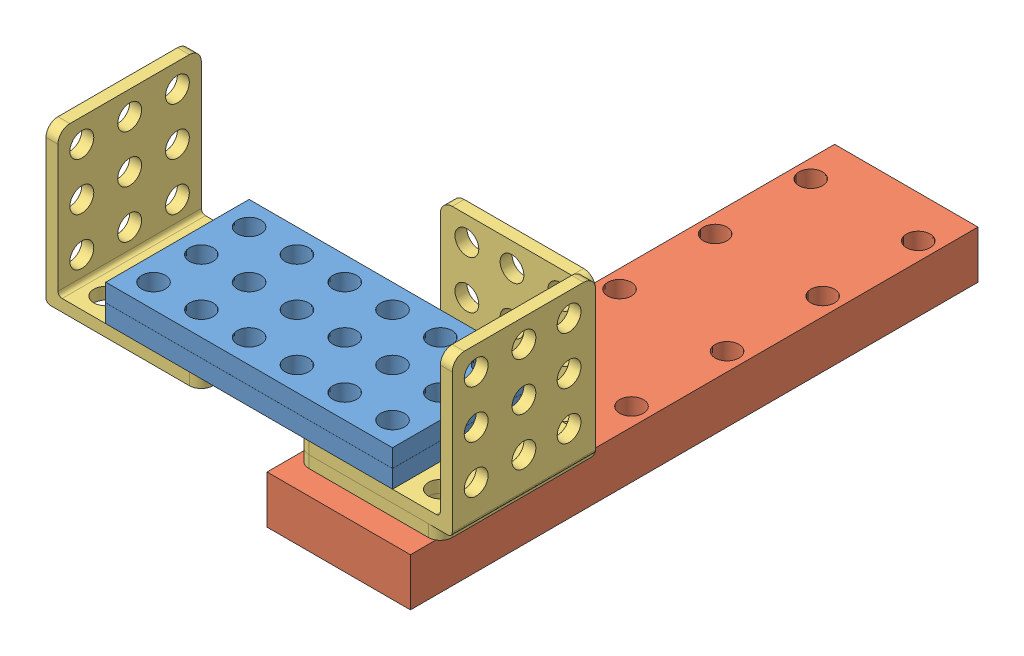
SolidWorks assembly 装甲后.SLDASM, configuration 默认 (file format 10000). Lengths in mm.
Overall size (68 36 95).
6 component instances, 3 part files, 12 mates.
Components (placement in the parent):
- 6x3-1: 6x3.SLDPRT [默认] at (35.4251 -50.7156 52.7098) size (48 3 24)
- 6孔-1: 6孔.SLDPRT [默认] at (57.8547 -62.7156 51.4857) x (0 0 -1) z (1 0 0) size (95 8 24)
- 搞了半天的90度折角件-1: 搞了半天的90度折角件.SLDPRT [默认] at (3.6917 -26.7156 41.7765) x (0 -1 0) z (0 0 1) size (26 26 24)
- 6x3-2: 6x3.SLDPRT [默认] at (35.4251 -47.7041 52.7098) size (48 3 24)
- 搞了半天的90度折角件-2: 搞了半天的90度折角件.SLDPRT [默认] at (45.6917 -52.7156 41.7765) size (26 26 24)
- 搞了半天的90度折角件-3: 搞了半天的90度折角件.SLDPRT [默认] at (45.6917 -54.7156 65.7765) x (0 0 -1) z (1 0 0) size (26 26 24)
Mates (geometry in assembly coordinates):
- 平行1: parallel aligned: line of 6x3-1 through (13.6917 -47.7156 41.7765) axis (0 0 1); line of 搞了半天的90度折角件-1 through (29.6917 -50.7156 43.7765) axis (0 0 1)
- 同心2: concentric aligned: circle of 6x3-1; circle of 6x3-2
- 锁定2: lock: unknown of 6x3-1; unknown of 6x3-2
- 同心3: concentric aligned: circle of 搞了半天的90度折角件-2; circle of 搞了半天的90度折角件-3
- 重合10: coincident aligned: circle of 搞了半天的90度折角件-2; circle of 搞了半天的90度折角件-3
- 重合12: coincident aligned: circle of 6x3-1; circle of 搞了半天的90度折角件-2
- 同心4: concentric aligned: circle of 6x3-2; circle of 搞了半天的90度折角件-3
- 重合17: coincident aligned: circle of 6x3-1; circle of 搞了半天的90度折角件-1
- 同心6: concentric aligned: circle of 6x3-1; circle of 搞了半天的90度折角件-1
- 重合20: coincident aligned: circle of 6孔-1; circle of 搞了半天的90度折角件-3
- 平行3: parallel aligned: line of 6孔-1 through (44.6917 -62.7156 -25.2235) axis (0 0 1); line of 搞了半天的90度折角件-3 through (45.6917 -54.7156 40.4765) axis (0 0 1)
- 锁定3: lock: unknown of 6x3-1; unknown of 6孔-1
